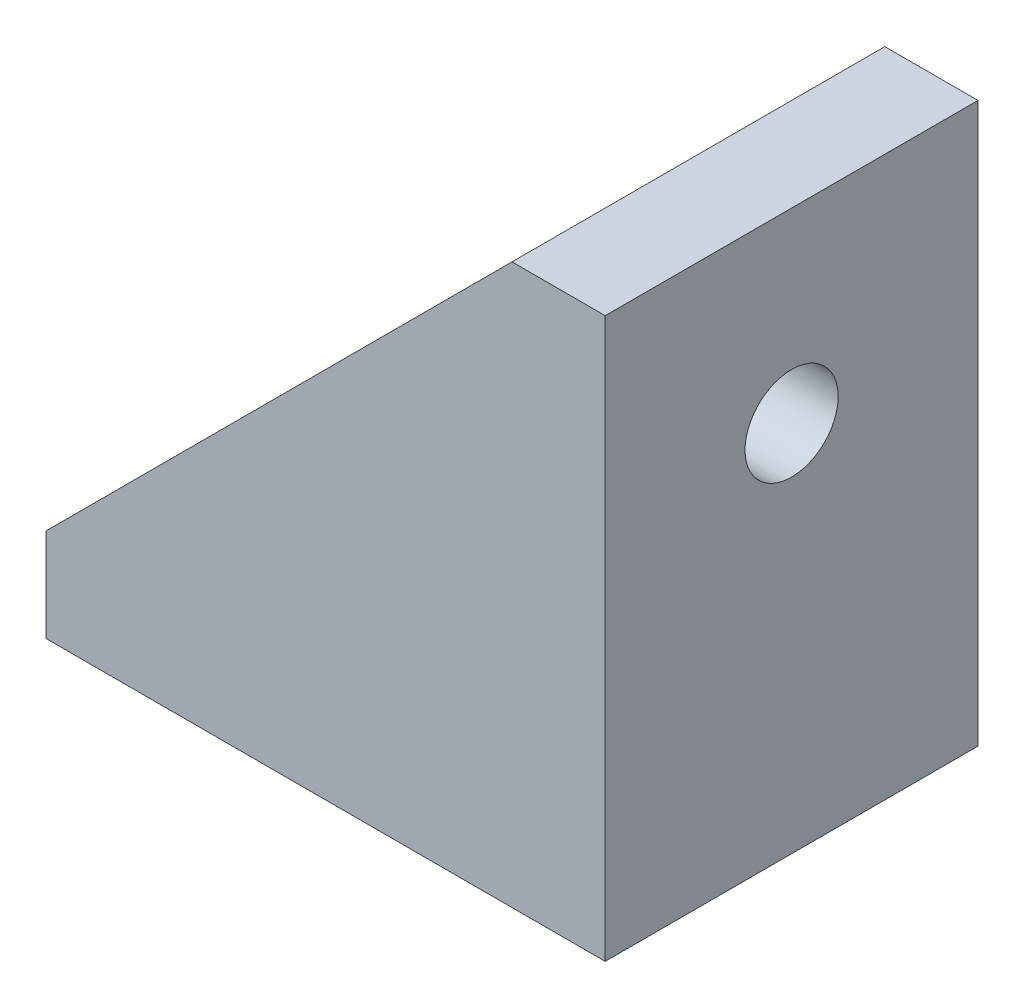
ISO-10303-21;
HEADER;
FILE_DESCRIPTION(('STEP AP214'),'2;1');
FILE_NAME('part.step','',(''),(''),'','','');
FILE_SCHEMA(('AUTOMOTIVE_DESIGN { 1 0 10303 214 1 1 1 1 }'));
ENDSEC;
DATA;
#1=APPLICATION_CONTEXT('core data for automotive mechanical design processes');
#2=APPLICATION_PROTOCOL_DEFINITION('international standard','automotive_design',2000,#1);
#3=PRODUCT_CONTEXT('',#1,'mechanical');
#4=PRODUCT('Part','Part','',(#3));
#5=PRODUCT_RELATED_PRODUCT_CATEGORY('part','',(#4));
#6=PRODUCT_DEFINITION_FORMATION('','',#4);
#7=PRODUCT_DEFINITION_CONTEXT('part definition',#1,'design');
#8=PRODUCT_DEFINITION('design','',#6,#7);
#9=PRODUCT_DEFINITION_SHAPE('','',#8);
#10=(LENGTH_UNIT() NAMED_UNIT(*) SI_UNIT(.MILLI.,.METRE.));
#11=(NAMED_UNIT(*) PLANE_ANGLE_UNIT() SI_UNIT($,.RADIAN.));
#12=(NAMED_UNIT(*) SI_UNIT($,.STERADIAN.) SOLID_ANGLE_UNIT());
#13=UNCERTAINTY_MEASURE_WITH_UNIT(LENGTH_MEASURE(1.E-05),#10,'distance_accuracy_value','');
#14=(GEOMETRIC_REPRESENTATION_CONTEXT(3) GLOBAL_UNCERTAINTY_ASSIGNED_CONTEXT((#13)) GLOBAL_UNIT_ASSIGNED_CONTEXT((#10,
#11,#12)) REPRESENTATION_CONTEXT('',''));
#15=CARTESIAN_POINT('',(0.,0.,0.));
#16=DIRECTION('',(0.,0.,1.));
#17=DIRECTION('',(1.,0.,0.));
#18=AXIS2_PLACEMENT_3D('',#15,#16,#17);
#19=CARTESIAN_POINT('',(-5.,30.,20.));
#20=DIRECTION('',(0.707106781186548,-0.707106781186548,0.));
#21=DIRECTION('',(0.707106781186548,0.707106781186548,0.));
#22=AXIS2_PLACEMENT_3D('',#19,#20,#21);
#23=PLANE('',#22);
#24=DIRECTION('',(-0.707106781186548,-0.707106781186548,0.));
#25=VECTOR('',#24,1.);
#26=CARTESIAN_POINT('',(-5.,30.,2.));
#27=LINE('',#26,#25);
#28=CARTESIAN_POINT('',(-5.,30.,2.));
#29=VERTEX_POINT('',#28);
#30=CARTESIAN_POINT('',(-30.,5.,2.));
#31=VERTEX_POINT('',#30);
#32=EDGE_CURVE('E97',#29,#31,#27,.T.);
#33=ORIENTED_EDGE('',*,*,#32,.F.);
#34=DIRECTION('',(0.,0.,-1.));
#35=VECTOR('',#34,1.);
#36=CARTESIAN_POINT('',(-5.,30.,20.));
#37=LINE('',#36,#35);
#38=CARTESIAN_POINT('',(-5.,30.,0.));
#39=VERTEX_POINT('',#38);
#40=EDGE_CURVE('E208',#29,#39,#37,.T.);
#41=ORIENTED_EDGE('',*,*,#40,.T.);
#42=DIRECTION('',(-0.707106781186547,-0.707106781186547,0.));
#43=VECTOR('',#42,1.);
#44=CARTESIAN_POINT('',(-5.,30.,0.));
#45=LINE('',#44,#43);
#46=CARTESIAN_POINT('',(-30.,5.,0.));
#47=VERTEX_POINT('',#46);
#48=EDGE_CURVE('E203',#39,#47,#45,.T.);
#49=ORIENTED_EDGE('',*,*,#48,.T.);
#50=DIRECTION('',(0.,0.,-1.));
#51=VECTOR('',#50,1.);
#52=CARTESIAN_POINT('',(-30.,5.,20.));
#53=LINE('',#52,#51);
#54=EDGE_CURVE('E199',#31,#47,#53,.T.);
#55=ORIENTED_EDGE('',*,*,#54,.F.);
#56=EDGE_LOOP('',(#33,#41,#49,#55));
#57=FACE_BOUND('',#56,.T.);
#58=ADVANCED_FACE('F89',(#57),#23,.F.);
#59=CARTESIAN_POINT('',(-5.,30.,20.));
#60=VERTEX_POINT('',#59);
#61=CARTESIAN_POINT('',(-5.,30.,18.));
#62=VERTEX_POINT('',#61);
#63=EDGE_CURVE('E207',#60,#62,#37,.T.);
#64=ORIENTED_EDGE('',*,*,#63,.T.);
#65=DIRECTION('',(-0.707106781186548,-0.707106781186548,0.));
#66=VECTOR('',#65,1.);
#67=CARTESIAN_POINT('',(-5.,30.,18.));
#68=LINE('',#67,#66);
#69=CARTESIAN_POINT('',(-30.,5.,18.));
#70=VERTEX_POINT('',#69);
#71=EDGE_CURVE('E12',#62,#70,#68,.T.);
#72=ORIENTED_EDGE('',*,*,#71,.T.);
#73=CARTESIAN_POINT('',(-30.,5.,20.));
#74=VERTEX_POINT('',#73);
#75=EDGE_CURVE('E111',#74,#70,#53,.T.);
#76=ORIENTED_EDGE('',*,*,#75,.F.);
#77=DIRECTION('',(-0.707106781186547,-0.707106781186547,0.));
#78=VECTOR('',#77,1.);
#79=CARTESIAN_POINT('',(-5.,30.,20.));
#80=LINE('',#79,#78);
#81=EDGE_CURVE('E198',#60,#74,#80,.T.);
#82=ORIENTED_EDGE('',*,*,#81,.F.);
#83=EDGE_LOOP('',(#64,#72,#76,#82));
#84=FACE_BOUND('',#83,.T.);
#85=ADVANCED_FACE('F261',(#84),#23,.F.);
#86=CARTESIAN_POINT('',(0.,0.,0.));
#87=DIRECTION('',(0.,0.,1.));
#88=DIRECTION('',(1.,0.,0.));
#89=AXIS2_PLACEMENT_3D('',#86,#87,#88);
#90=PLANE('',#89);
#91=DIRECTION('',(-1.,0.,0.));
#92=VECTOR('',#91,1.);
#93=CARTESIAN_POINT('',(0.,30.,0.));
#94=LINE('',#93,#92);
#95=CARTESIAN_POINT('',(0.,30.,0.));
#96=VERTEX_POINT('',#95);
#97=EDGE_CURVE('E223',#96,#39,#94,.T.);
#98=ORIENTED_EDGE('',*,*,#97,.F.);
#99=DIRECTION('',(0.,1.,0.));
#100=VECTOR('',#99,1.);
#101=CARTESIAN_POINT('',(0.,0.,0.));
#102=LINE('',#101,#100);
#103=CARTESIAN_POINT('',(0.,0.,0.));
#104=VERTEX_POINT('',#103);
#105=EDGE_CURVE('E217',#104,#96,#102,.T.);
#106=ORIENTED_EDGE('',*,*,#105,.F.);
#107=DIRECTION('',(-1.,0.,0.));
#108=VECTOR('',#107,1.);
#109=CARTESIAN_POINT('',(0.,0.,0.));
#110=LINE('',#109,#108);
#111=CARTESIAN_POINT('',(-30.,0.,0.));
#112=VERTEX_POINT('',#111);
#113=EDGE_CURVE('E150',#104,#112,#110,.T.);
#114=ORIENTED_EDGE('',*,*,#113,.T.);
#115=DIRECTION('',(0.,1.,0.));
#116=VECTOR('',#115,1.);
#117=CARTESIAN_POINT('',(-30.,0.,0.));
#118=LINE('',#117,#116);
#119=EDGE_CURVE('E175',#112,#47,#118,.T.);
#120=ORIENTED_EDGE('',*,*,#119,.T.);
#121=ORIENTED_EDGE('',*,*,#48,.F.);
#122=EDGE_LOOP('',(#98,#106,#114,#120,#121));
#123=FACE_BOUND('',#122,.T.);
#124=ADVANCED_FACE('F310',(#123),#90,.F.);
#125=CARTESIAN_POINT('',(0.,0.,20.));
#126=DIRECTION('',(0.,0.,1.));
#127=DIRECTION('',(1.,0.,0.));
#128=AXIS2_PLACEMENT_3D('',#125,#126,#127);
#129=PLANE('',#128);
#130=ORIENTED_EDGE('',*,*,#81,.T.);
#131=DIRECTION('',(0.,1.,0.));
#132=VECTOR('',#131,1.);
#133=CARTESIAN_POINT('',(-30.,0.,20.));
#134=LINE('',#133,#132);
#135=CARTESIAN_POINT('',(-30.,0.,20.));
#136=VERTEX_POINT('',#135);
#137=EDGE_CURVE('E239',#136,#74,#134,.T.);
#138=ORIENTED_EDGE('',*,*,#137,.F.);
#139=DIRECTION('',(-1.,0.,0.));
#140=VECTOR('',#139,1.);
#141=CARTESIAN_POINT('',(0.,0.,20.));
#142=LINE('',#141,#140);
#143=CARTESIAN_POINT('',(0.,0.,20.));
#144=VERTEX_POINT('',#143);
#145=EDGE_CURVE('E220',#144,#136,#142,.T.);
#146=ORIENTED_EDGE('',*,*,#145,.F.);
#147=DIRECTION('',(0.,1.,0.));
#148=VECTOR('',#147,1.);
#149=CARTESIAN_POINT('',(0.,0.,20.));
#150=LINE('',#149,#148);
#151=CARTESIAN_POINT('',(0.,30.,20.));
#152=VERTEX_POINT('',#151);
#153=EDGE_CURVE('E222',#144,#152,#150,.T.);
#154=ORIENTED_EDGE('',*,*,#153,.T.);
#155=DIRECTION('',(-1.,0.,0.));
#156=VECTOR('',#155,1.);
#157=CARTESIAN_POINT('',(0.,30.,20.));
#158=LINE('',#157,#156);
#159=EDGE_CURVE('E213',#152,#60,#158,.T.);
#160=ORIENTED_EDGE('',*,*,#159,.T.);
#161=EDGE_LOOP('',(#130,#138,#146,#154,#160));
#162=FACE_BOUND('',#161,.T.);
#163=ADVANCED_FACE('F259',(#162),#129,.T.);
#164=CARTESIAN_POINT('',(0.,0.,20.));
#165=DIRECTION('',(0.,-1.,0.));
#166=DIRECTION('',(1.,0.,0.));
#167=AXIS2_PLACEMENT_3D('',#164,#165,#166);
#168=PLANE('',#167);
#169=CARTESIAN_POINT('',(-20.,0.,10.));
#170=DIRECTION('',(0.,1.,0.));
#171=DIRECTION('',(0.,0.,1.));
#172=AXIS2_PLACEMENT_3D('',#169,#170,#171);
#173=CIRCLE('',#172,2.5);
#174=CARTESIAN_POINT('',(-20.,0.,12.5));
#175=VERTEX_POINT('',#174);
#176=EDGE_CURVE('E269',#175,#175,#173,.T.);
#177=ORIENTED_EDGE('',*,*,#176,.T.);
#178=EDGE_LOOP('',(#177));
#179=FACE_BOUND('',#178,.T.);
#180=ORIENTED_EDGE('',*,*,#113,.F.);
#181=DIRECTION('',(0.,0.,-1.));
#182=VECTOR('',#181,1.);
#183=CARTESIAN_POINT('',(0.,0.,20.));
#184=LINE('',#183,#182);
#185=EDGE_CURVE('E202',#144,#104,#184,.T.);
#186=ORIENTED_EDGE('',*,*,#185,.F.);
#187=ORIENTED_EDGE('',*,*,#145,.T.);
#188=DIRECTION('',(0.,0.,-1.));
#189=VECTOR('',#188,1.);
#190=CARTESIAN_POINT('',(-30.,0.,20.));
#191=LINE('',#190,#189);
#192=EDGE_CURVE('E228',#136,#112,#191,.T.);
#193=ORIENTED_EDGE('',*,*,#192,.T.);
#194=EDGE_LOOP('',(#180,#186,#187,#193));
#195=FACE_BOUND('',#194,.T.);
#196=ADVANCED_FACE('F282',(#179,#195),#168,.T.);
#197=CARTESIAN_POINT('',(0.,0.,20.));
#198=DIRECTION('',(-1.,0.,0.));
#199=DIRECTION('',(0.,0.,1.));
#200=AXIS2_PLACEMENT_3D('',#197,#198,#199);
#201=PLANE('',#200);
#202=CARTESIAN_POINT('',(0.,20.,10.));
#203=DIRECTION('',(-1.,0.,0.));
#204=DIRECTION('',(0.,0.,1.));
#205=AXIS2_PLACEMENT_3D('',#202,#203,#204);
#206=CIRCLE('',#205,2.5);
#207=CARTESIAN_POINT('',(0.,20.,12.5));
#208=VERTEX_POINT('',#207);
#209=EDGE_CURVE('E194',#208,#208,#206,.T.);
#210=ORIENTED_EDGE('',*,*,#209,.T.);
#211=EDGE_LOOP('',(#210));
#212=FACE_BOUND('',#211,.T.);
#213=ORIENTED_EDGE('',*,*,#105,.T.);
#214=DIRECTION('',(0.,0.,-1.));
#215=VECTOR('',#214,1.);
#216=CARTESIAN_POINT('',(0.,30.,20.));
#217=LINE('',#216,#215);
#218=EDGE_CURVE('E221',#152,#96,#217,.T.);
#219=ORIENTED_EDGE('',*,*,#218,.F.);
#220=ORIENTED_EDGE('',*,*,#153,.F.);
#221=ORIENTED_EDGE('',*,*,#185,.T.);
#222=EDGE_LOOP('',(#213,#219,#220,#221));
#223=FACE_BOUND('',#222,.T.);
#224=ADVANCED_FACE('F315',(#212,#223),#201,.F.);
#225=CARTESIAN_POINT('',(0.,30.,20.));
#226=DIRECTION('',(0.,-1.,0.));
#227=DIRECTION('',(0.,0.,-1.));
#228=AXIS2_PLACEMENT_3D('',#225,#226,#227);
#229=PLANE('',#228);
#230=ORIENTED_EDGE('',*,*,#97,.T.);
#231=ORIENTED_EDGE('',*,*,#40,.F.);
#232=DIRECTION('',(0.,0.,1.));
#233=VECTOR('',#232,1.);
#234=CARTESIAN_POINT('',(-5.,30.,2.));
#235=LINE('',#234,#233);
#236=EDGE_CURVE('E185',#29,#62,#235,.T.);
#237=ORIENTED_EDGE('',*,*,#236,.T.);
#238=ORIENTED_EDGE('',*,*,#63,.F.);
#239=ORIENTED_EDGE('',*,*,#159,.F.);
#240=ORIENTED_EDGE('',*,*,#218,.T.);
#241=EDGE_LOOP('',(#230,#231,#237,#238,#239,#240));
#242=FACE_BOUND('',#241,.T.);
#243=ADVANCED_FACE('F263',(#242),#229,.F.);
#244=CARTESIAN_POINT('',(-30.,0.,20.));
#245=DIRECTION('',(-1.,0.,0.));
#246=DIRECTION('',(0.,0.,1.));
#247=AXIS2_PLACEMENT_3D('',#244,#245,#246);
#248=PLANE('',#247);
#249=ORIENTED_EDGE('',*,*,#119,.F.);
#250=ORIENTED_EDGE('',*,*,#192,.F.);
#251=ORIENTED_EDGE('',*,*,#137,.T.);
#252=ORIENTED_EDGE('',*,*,#75,.T.);
#253=DIRECTION('',(0.,0.,1.));
#254=VECTOR('',#253,1.);
#255=CARTESIAN_POINT('',(-30.,5.,2.));
#256=LINE('',#255,#254);
#257=EDGE_CURVE('E174',#31,#70,#256,.T.);
#258=ORIENTED_EDGE('',*,*,#257,.F.);
#259=ORIENTED_EDGE('',*,*,#54,.T.);
#260=EDGE_LOOP('',(#249,#250,#251,#252,#258,#259));
#261=FACE_BOUND('',#260,.T.);
#262=ADVANCED_FACE('F95',(#261),#248,.T.);
#263=CARTESIAN_POINT('',(-5.,5.,18.));
#264=DIRECTION('',(0.,0.,1.));
#265=DIRECTION('',(1.,0.,0.));
#266=AXIS2_PLACEMENT_3D('',#263,#264,#265);
#267=PLANE('',#266);
#268=DIRECTION('',(0.,1.,0.));
#269=VECTOR('',#268,1.);
#270=CARTESIAN_POINT('',(-5.,5.,18.));
#271=LINE('',#270,#269);
#272=CARTESIAN_POINT('',(-5.,5.,18.));
#273=VERTEX_POINT('',#272);
#274=EDGE_CURVE('E177',#273,#62,#271,.T.);
#275=ORIENTED_EDGE('',*,*,#274,.F.);
#276=DIRECTION('',(-1.,0.,0.));
#277=VECTOR('',#276,1.);
#278=CARTESIAN_POINT('',(-5.,5.,18.));
#279=LINE('',#278,#277);
#280=EDGE_CURVE('E167',#273,#70,#279,.T.);
#281=ORIENTED_EDGE('',*,*,#280,.T.);
#282=ORIENTED_EDGE('',*,*,#71,.F.);
#283=EDGE_LOOP('',(#275,#281,#282));
#284=FACE_BOUND('',#283,.T.);
#285=ADVANCED_FACE('F179',(#284),#267,.F.);
#286=CARTESIAN_POINT('',(-5.,5.,2.));
#287=DIRECTION('',(0.,0.,1.));
#288=DIRECTION('',(1.,0.,0.));
#289=AXIS2_PLACEMENT_3D('',#286,#287,#288);
#290=PLANE('',#289);
#291=ORIENTED_EDGE('',*,*,#32,.T.);
#292=DIRECTION('',(-1.,0.,0.));
#293=VECTOR('',#292,1.);
#294=CARTESIAN_POINT('',(-5.,5.,2.));
#295=LINE('',#294,#293);
#296=CARTESIAN_POINT('',(-5.,5.,2.));
#297=VERTEX_POINT('',#296);
#298=EDGE_CURVE('E106',#297,#31,#295,.T.);
#299=ORIENTED_EDGE('',*,*,#298,.F.);
#300=DIRECTION('',(0.,1.,0.));
#301=VECTOR('',#300,1.);
#302=CARTESIAN_POINT('',(-5.,5.,2.));
#303=LINE('',#302,#301);
#304=EDGE_CURVE('E152',#297,#29,#303,.T.);
#305=ORIENTED_EDGE('',*,*,#304,.T.);
#306=EDGE_LOOP('',(#291,#299,#305));
#307=FACE_BOUND('',#306,.T.);
#308=ADVANCED_FACE('F249',(#307),#290,.T.);
#309=CARTESIAN_POINT('',(-5.,5.,2.));
#310=DIRECTION('',(0.,-1.,0.));
#311=DIRECTION('',(0.,0.,-1.));
#312=AXIS2_PLACEMENT_3D('',#309,#310,#311);
#313=PLANE('',#312);
#314=CARTESIAN_POINT('',(-20.,5.,10.));
#315=DIRECTION('',(0.,1.,0.));
#316=DIRECTION('',(0.,0.,1.));
#317=AXIS2_PLACEMENT_3D('',#314,#315,#316);
#318=CIRCLE('',#317,2.5);
#319=CARTESIAN_POINT('',(-20.,5.,12.5));
#320=VERTEX_POINT('',#319);
#321=EDGE_CURVE('E273',#320,#320,#318,.T.);
#322=ORIENTED_EDGE('',*,*,#321,.F.);
#323=EDGE_LOOP('',(#322));
#324=FACE_BOUND('',#323,.T.);
#325=ORIENTED_EDGE('',*,*,#257,.T.);
#326=ORIENTED_EDGE('',*,*,#280,.F.);
#327=DIRECTION('',(0.,0.,1.));
#328=VECTOR('',#327,1.);
#329=CARTESIAN_POINT('',(-5.,5.,2.));
#330=LINE('',#329,#328);
#331=EDGE_CURVE('E171',#297,#273,#330,.T.);
#332=ORIENTED_EDGE('',*,*,#331,.F.);
#333=ORIENTED_EDGE('',*,*,#298,.T.);
#334=EDGE_LOOP('',(#325,#326,#332,#333));
#335=FACE_BOUND('',#334,.T.);
#336=ADVANCED_FACE('F166',(#324,#335),#313,.F.);
#337=CARTESIAN_POINT('',(-5.,0.,0.));
#338=DIRECTION('',(-1.,0.,0.));
#339=DIRECTION('',(0.,0.,1.));
#340=AXIS2_PLACEMENT_3D('',#337,#338,#339);
#341=PLANE('',#340);
#342=CARTESIAN_POINT('',(-5.,20.,10.));
#343=DIRECTION('',(-1.,0.,0.));
#344=DIRECTION('',(0.,0.,1.));
#345=AXIS2_PLACEMENT_3D('',#342,#343,#344);
#346=CIRCLE('',#345,2.5);
#347=CARTESIAN_POINT('',(-5.,20.,12.5));
#348=VERTEX_POINT('',#347);
#349=EDGE_CURVE('E266',#348,#348,#346,.T.);
#350=ORIENTED_EDGE('',*,*,#349,.F.);
#351=EDGE_LOOP('',(#350));
#352=FACE_BOUND('',#351,.T.);
#353=ORIENTED_EDGE('',*,*,#236,.F.);
#354=ORIENTED_EDGE('',*,*,#304,.F.);
#355=ORIENTED_EDGE('',*,*,#331,.T.);
#356=ORIENTED_EDGE('',*,*,#274,.T.);
#357=EDGE_LOOP('',(#353,#354,#355,#356));
#358=FACE_BOUND('',#357,.T.);
#359=ADVANCED_FACE('F184',(#352,#358),#341,.T.);
#360=CARTESIAN_POINT('',(0.,20.,10.));
#361=DIRECTION('',(-1.,0.,0.));
#362=DIRECTION('',(0.,0.,1.));
#363=AXIS2_PLACEMENT_3D('',#360,#361,#362);
#364=CYLINDRICAL_SURFACE('',#363,2.5);
#365=ORIENTED_EDGE('',*,*,#209,.F.);
#366=EDGE_LOOP('',(#365));
#367=FACE_BOUND('',#366,.T.);
#368=ORIENTED_EDGE('',*,*,#349,.T.);
#369=EDGE_LOOP('',(#368));
#370=FACE_BOUND('',#369,.T.);
#371=ADVANCED_FACE('F289',(#367,#370),#364,.F.);
#372=CARTESIAN_POINT('',(-20.,0.,10.));
#373=DIRECTION('',(0.,1.,0.));
#374=DIRECTION('',(0.,0.,1.));
#375=AXIS2_PLACEMENT_3D('',#372,#373,#374);
#376=CYLINDRICAL_SURFACE('',#375,2.5);
#377=ORIENTED_EDGE('',*,*,#176,.F.);
#378=EDGE_LOOP('',(#377));
#379=FACE_BOUND('',#378,.T.);
#380=ORIENTED_EDGE('',*,*,#321,.T.);
#381=EDGE_LOOP('',(#380));
#382=FACE_BOUND('',#381,.T.);
#383=ADVANCED_FACE('F285',(#379,#382),#376,.F.);
#384=CLOSED_SHELL('',(#58,#85,#124,#163,#196,#224,#243,#262,#285,#308,#336,#359,#371,#383));
#385=MANIFOLD_SOLID_BREP('B2',#384);
#386=ADVANCED_BREP_SHAPE_REPRESENTATION('',(#18,#385),#14);
#387=SHAPE_DEFINITION_REPRESENTATION(#9,#386);
ENDSEC;
END-ISO-10303-21;
